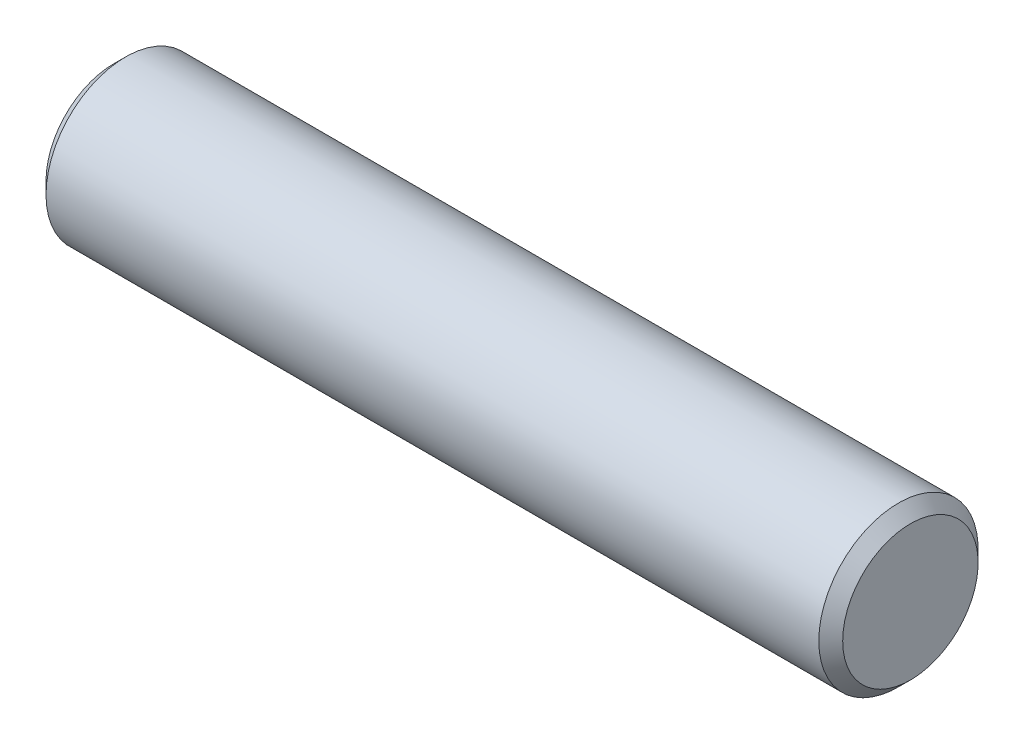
from build123d import *


with BuildPart() as part:
    # BodySke → BaseBody (revolve)
    with BuildSketch(Plane.XY, mode=Mode.PRIVATE) as basebody_sk:
        Polygon((1.5, 10), (0, 8.5), (0, 0), (100, 0), (100, 8.5), (98.5, 10), align=None)
    revolve(basebody_sk.sketch.rotate(Axis((-3.175, 0, 0), (1, 0, 0)), 90), axis=Axis((-3.175, 0, 0), (1, 0, 0)))


solid = part.part
